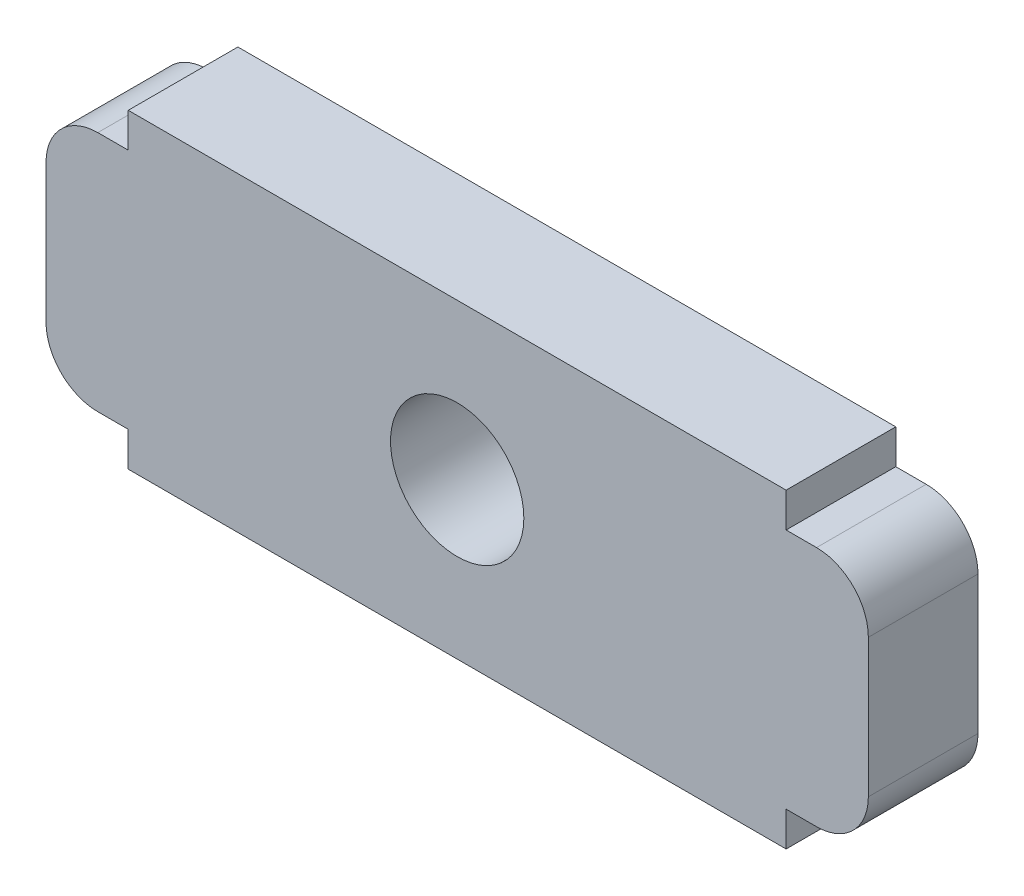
ISO-10303-21;
HEADER;
FILE_DESCRIPTION(('STEP AP214'),'2;1');
FILE_NAME('part.step','',(''),(''),'','','');
FILE_SCHEMA(('AUTOMOTIVE_DESIGN { 1 0 10303 214 1 1 1 1 }'));
ENDSEC;
DATA;
#1=APPLICATION_CONTEXT('core data for automotive mechanical design processes');
#2=APPLICATION_PROTOCOL_DEFINITION('international standard','automotive_design',2000,#1);
#3=PRODUCT_CONTEXT('',#1,'mechanical');
#4=PRODUCT('Part','Part','',(#3));
#5=PRODUCT_RELATED_PRODUCT_CATEGORY('part','',(#4));
#6=PRODUCT_DEFINITION_FORMATION('','',#4);
#7=PRODUCT_DEFINITION_CONTEXT('part definition',#1,'design');
#8=PRODUCT_DEFINITION('design','',#6,#7);
#9=PRODUCT_DEFINITION_SHAPE('','',#8);
#10=(LENGTH_UNIT() NAMED_UNIT(*) SI_UNIT(.MILLI.,.METRE.));
#11=(NAMED_UNIT(*) PLANE_ANGLE_UNIT() SI_UNIT($,.RADIAN.));
#12=(NAMED_UNIT(*) SI_UNIT($,.STERADIAN.) SOLID_ANGLE_UNIT());
#13=UNCERTAINTY_MEASURE_WITH_UNIT(LENGTH_MEASURE(1.E-05),#10,'distance_accuracy_value','');
#14=(GEOMETRIC_REPRESENTATION_CONTEXT(3) GLOBAL_UNCERTAINTY_ASSIGNED_CONTEXT((#13)) GLOBAL_UNIT_ASSIGNED_CONTEXT((#10,
#11,#12)) REPRESENTATION_CONTEXT('',''));
#15=CARTESIAN_POINT('',(0.,0.,0.));
#16=DIRECTION('',(0.,0.,1.));
#17=DIRECTION('',(1.,0.,0.));
#18=AXIS2_PLACEMENT_3D('',#15,#16,#17);
#19=CARTESIAN_POINT('',(0.,0.,3.175));
#20=DIRECTION('',(0.,0.,1.));
#21=DIRECTION('',(1.,0.,0.));
#22=AXIS2_PLACEMENT_3D('',#19,#20,#21);
#23=PLANE('',#22);
#24=DIRECTION('',(0.,1.,0.));
#25=VECTOR('',#24,1.);
#26=CARTESIAN_POINT('',(11.90625,3.5,3.175));
#27=LINE('',#26,#25);
#28=CARTESIAN_POINT('',(11.90625,-2.,3.175));
#29=VERTEX_POINT('',#28);
#30=CARTESIAN_POINT('',(11.90625,2.,3.175));
#31=VERTEX_POINT('',#30);
#32=EDGE_CURVE('E284',#29,#31,#27,.T.);
#33=ORIENTED_EDGE('',*,*,#32,.T.);
#34=CARTESIAN_POINT('',(10.40625,2.,3.175));
#35=DIRECTION('',(0.,0.,1.));
#36=DIRECTION('',(1.,0.,0.));
#37=AXIS2_PLACEMENT_3D('',#34,#35,#36);
#38=CIRCLE('',#37,1.5);
#39=CARTESIAN_POINT('',(10.40625,3.5,3.175));
#40=VERTEX_POINT('',#39);
#41=EDGE_CURVE('E200',#31,#40,#38,.T.);
#42=ORIENTED_EDGE('',*,*,#41,.T.);
#43=DIRECTION('',(-1.,0.,0.));
#44=VECTOR('',#43,1.);
#45=CARTESIAN_POINT('',(9.525,3.5,3.175));
#46=LINE('',#45,#44);
#47=CARTESIAN_POINT('',(9.525,3.5,3.175));
#48=VERTEX_POINT('',#47);
#49=EDGE_CURVE('E165',#40,#48,#46,.T.);
#50=ORIENTED_EDGE('',*,*,#49,.T.);
#51=DIRECTION('',(0.,1.,0.));
#52=VECTOR('',#51,1.);
#53=CARTESIAN_POINT('',(9.525,4.5,3.175));
#54=LINE('',#53,#52);
#55=CARTESIAN_POINT('',(9.525,4.5,3.175));
#56=VERTEX_POINT('',#55);
#57=EDGE_CURVE('E159',#48,#56,#54,.T.);
#58=ORIENTED_EDGE('',*,*,#57,.T.);
#59=DIRECTION('',(-1.,0.,0.));
#60=VECTOR('',#59,1.);
#61=CARTESIAN_POINT('',(-9.525,4.5,3.175));
#62=LINE('',#61,#60);
#63=CARTESIAN_POINT('',(-9.525,4.5,3.175));
#64=VERTEX_POINT('',#63);
#65=EDGE_CURVE('E149',#56,#64,#62,.T.);
#66=ORIENTED_EDGE('',*,*,#65,.T.);
#67=DIRECTION('',(0.,-1.,0.));
#68=VECTOR('',#67,1.);
#69=CARTESIAN_POINT('',(-9.525,4.5,3.175));
#70=LINE('',#69,#68);
#71=CARTESIAN_POINT('',(-9.525,3.5,3.175));
#72=VERTEX_POINT('',#71);
#73=EDGE_CURVE('E158',#64,#72,#70,.T.);
#74=ORIENTED_EDGE('',*,*,#73,.T.);
#75=DIRECTION('',(-1.,0.,0.));
#76=VECTOR('',#75,1.);
#77=CARTESIAN_POINT('',(-9.525,3.5,3.175));
#78=LINE('',#77,#76);
#79=CARTESIAN_POINT('',(-10.40625,3.5,3.175));
#80=VERTEX_POINT('',#79);
#81=EDGE_CURVE('E221',#72,#80,#78,.T.);
#82=ORIENTED_EDGE('',*,*,#81,.T.);
#83=CARTESIAN_POINT('',(-10.40625,2.,3.175));
#84=DIRECTION('',(0.,0.,1.));
#85=DIRECTION('',(1.,0.,0.));
#86=AXIS2_PLACEMENT_3D('',#83,#84,#85);
#87=CIRCLE('',#86,1.5);
#88=CARTESIAN_POINT('',(-11.90625,2.,3.175));
#89=VERTEX_POINT('',#88);
#90=EDGE_CURVE('E195',#80,#89,#87,.T.);
#91=ORIENTED_EDGE('',*,*,#90,.T.);
#92=DIRECTION('',(0.,-1.,0.));
#93=VECTOR('',#92,1.);
#94=CARTESIAN_POINT('',(-11.90625,3.5,3.175));
#95=LINE('',#94,#93);
#96=CARTESIAN_POINT('',(-11.90625,-2.,3.175));
#97=VERTEX_POINT('',#96);
#98=EDGE_CURVE('E213',#89,#97,#95,.T.);
#99=ORIENTED_EDGE('',*,*,#98,.T.);
#100=CARTESIAN_POINT('',(-10.40625,-2.,3.175));
#101=DIRECTION('',(0.,0.,1.));
#102=DIRECTION('',(1.,0.,0.));
#103=AXIS2_PLACEMENT_3D('',#100,#101,#102);
#104=CIRCLE('',#103,1.5);
#105=CARTESIAN_POINT('',(-10.40625,-3.5,3.175));
#106=VERTEX_POINT('',#105);
#107=EDGE_CURVE('E57',#97,#106,#104,.T.);
#108=ORIENTED_EDGE('',*,*,#107,.T.);
#109=DIRECTION('',(1.,0.,0.));
#110=VECTOR('',#109,1.);
#111=CARTESIAN_POINT('',(-11.90625,-3.5,3.175));
#112=LINE('',#111,#110);
#113=CARTESIAN_POINT('',(-9.525,-3.5,3.175));
#114=VERTEX_POINT('',#113);
#115=EDGE_CURVE('E220',#106,#114,#112,.T.);
#116=ORIENTED_EDGE('',*,*,#115,.T.);
#117=DIRECTION('',(0.,-1.,0.));
#118=VECTOR('',#117,1.);
#119=CARTESIAN_POINT('',(-9.525,-3.5,3.175));
#120=LINE('',#119,#118);
#121=CARTESIAN_POINT('',(-9.525,-4.5,3.175));
#122=VERTEX_POINT('',#121);
#123=EDGE_CURVE('E292',#114,#122,#120,.T.);
#124=ORIENTED_EDGE('',*,*,#123,.T.);
#125=DIRECTION('',(1.,0.,0.));
#126=VECTOR('',#125,1.);
#127=CARTESIAN_POINT('',(-9.525,-4.5,3.175));
#128=LINE('',#127,#126);
#129=CARTESIAN_POINT('',(9.525,-4.5,3.175));
#130=VERTEX_POINT('',#129);
#131=EDGE_CURVE('E290',#122,#130,#128,.T.);
#132=ORIENTED_EDGE('',*,*,#131,.T.);
#133=DIRECTION('',(0.,1.,0.));
#134=VECTOR('',#133,1.);
#135=CARTESIAN_POINT('',(9.525,-3.5,3.175));
#136=LINE('',#135,#134);
#137=CARTESIAN_POINT('',(9.525,-3.5,3.175));
#138=VERTEX_POINT('',#137);
#139=EDGE_CURVE('E288',#130,#138,#136,.T.);
#140=ORIENTED_EDGE('',*,*,#139,.T.);
#141=DIRECTION('',(1.,0.,0.));
#142=VECTOR('',#141,1.);
#143=CARTESIAN_POINT('',(11.90625,-3.5,3.175));
#144=LINE('',#143,#142);
#145=CARTESIAN_POINT('',(10.40625,-3.5,3.175));
#146=VERTEX_POINT('',#145);
#147=EDGE_CURVE('E286',#138,#146,#144,.T.);
#148=ORIENTED_EDGE('',*,*,#147,.T.);
#149=CARTESIAN_POINT('',(10.40625,-2.,3.175));
#150=DIRECTION('',(0.,0.,1.));
#151=DIRECTION('',(1.,0.,0.));
#152=AXIS2_PLACEMENT_3D('',#149,#150,#151);
#153=CIRCLE('',#152,1.5);
#154=EDGE_CURVE('E198',#146,#29,#153,.T.);
#155=ORIENTED_EDGE('',*,*,#154,.T.);
#156=EDGE_LOOP('',(#33,#42,#50,#58,#66,#74,#82,#91,#99,#108,#116,#124,#132,#140,#148,#155));
#157=FACE_BOUND('',#156,.T.);
#158=CARTESIAN_POINT('',(0.,0.,3.175));
#159=DIRECTION('',(0.,0.,1.));
#160=DIRECTION('',(1.,0.,0.));
#161=AXIS2_PLACEMENT_3D('',#158,#159,#160);
#162=CIRCLE('',#161,1.9304);
#163=CARTESIAN_POINT('',(1.9304,0.,3.175));
#164=VERTEX_POINT('',#163);
#165=EDGE_CURVE('E282',#164,#164,#162,.T.);
#166=ORIENTED_EDGE('',*,*,#165,.F.);
#167=EDGE_LOOP('',(#166));
#168=FACE_BOUND('',#167,.T.);
#169=ADVANCED_FACE('F34',(#157,#168),#23,.T.);
#170=CARTESIAN_POINT('',(0.,0.,0.));
#171=DIRECTION('',(0.,0.,1.));
#172=DIRECTION('',(1.,0.,0.));
#173=AXIS2_PLACEMENT_3D('',#170,#171,#172);
#174=PLANE('',#173);
#175=DIRECTION('',(-1.,0.,0.));
#176=VECTOR('',#175,1.);
#177=CARTESIAN_POINT('',(9.525,3.5,0.));
#178=LINE('',#177,#176);
#179=CARTESIAN_POINT('',(10.40625,3.5,0.));
#180=VERTEX_POINT('',#179);
#181=CARTESIAN_POINT('',(9.525,3.5,0.));
#182=VERTEX_POINT('',#181);
#183=EDGE_CURVE('E169',#180,#182,#178,.T.);
#184=ORIENTED_EDGE('',*,*,#183,.F.);
#185=CARTESIAN_POINT('',(10.40625,2.,0.));
#186=DIRECTION('',(0.,0.,1.));
#187=DIRECTION('',(1.,0.,0.));
#188=AXIS2_PLACEMENT_3D('',#185,#186,#187);
#189=CIRCLE('',#188,1.5);
#190=CARTESIAN_POINT('',(11.90625,2.,0.));
#191=VERTEX_POINT('',#190);
#192=EDGE_CURVE('E188',#180,#191,#189,.F.);
#193=ORIENTED_EDGE('',*,*,#192,.T.);
#194=DIRECTION('',(0.,1.,0.));
#195=VECTOR('',#194,1.);
#196=CARTESIAN_POINT('',(11.90625,3.5,0.));
#197=LINE('',#196,#195);
#198=CARTESIAN_POINT('',(11.90625,-2.,0.));
#199=VERTEX_POINT('',#198);
#200=EDGE_CURVE('E250',#199,#191,#197,.T.);
#201=ORIENTED_EDGE('',*,*,#200,.F.);
#202=CARTESIAN_POINT('',(10.40625,-2.,0.));
#203=DIRECTION('',(0.,0.,1.));
#204=DIRECTION('',(1.,0.,0.));
#205=AXIS2_PLACEMENT_3D('',#202,#203,#204);
#206=CIRCLE('',#205,1.5);
#207=CARTESIAN_POINT('',(10.40625,-3.5,0.));
#208=VERTEX_POINT('',#207);
#209=EDGE_CURVE('E186',#199,#208,#206,.F.);
#210=ORIENTED_EDGE('',*,*,#209,.T.);
#211=DIRECTION('',(1.,0.,0.));
#212=VECTOR('',#211,1.);
#213=CARTESIAN_POINT('',(11.90625,-3.5,0.));
#214=LINE('',#213,#212);
#215=CARTESIAN_POINT('',(9.525,-3.5,0.));
#216=VERTEX_POINT('',#215);
#217=EDGE_CURVE('E248',#216,#208,#214,.T.);
#218=ORIENTED_EDGE('',*,*,#217,.F.);
#219=DIRECTION('',(0.,1.,0.));
#220=VECTOR('',#219,1.);
#221=CARTESIAN_POINT('',(9.525,-3.5,0.));
#222=LINE('',#221,#220);
#223=CARTESIAN_POINT('',(9.525,-4.5,0.));
#224=VERTEX_POINT('',#223);
#225=EDGE_CURVE('E246',#224,#216,#222,.T.);
#226=ORIENTED_EDGE('',*,*,#225,.F.);
#227=DIRECTION('',(1.,0.,0.));
#228=VECTOR('',#227,1.);
#229=CARTESIAN_POINT('',(-9.525,-4.5,0.));
#230=LINE('',#229,#228);
#231=CARTESIAN_POINT('',(-9.525,-4.5,0.));
#232=VERTEX_POINT('',#231);
#233=EDGE_CURVE('E239',#232,#224,#230,.T.);
#234=ORIENTED_EDGE('',*,*,#233,.F.);
#235=DIRECTION('',(0.,-1.,0.));
#236=VECTOR('',#235,1.);
#237=CARTESIAN_POINT('',(-9.525,-3.5,0.));
#238=LINE('',#237,#236);
#239=CARTESIAN_POINT('',(-9.525,-3.5,0.));
#240=VERTEX_POINT('',#239);
#241=EDGE_CURVE('E237',#240,#232,#238,.T.);
#242=ORIENTED_EDGE('',*,*,#241,.F.);
#243=DIRECTION('',(1.,0.,0.));
#244=VECTOR('',#243,1.);
#245=CARTESIAN_POINT('',(-11.90625,-3.5,0.));
#246=LINE('',#245,#244);
#247=CARTESIAN_POINT('',(-10.40625,-3.5,0.));
#248=VERTEX_POINT('',#247);
#249=EDGE_CURVE('E229',#248,#240,#246,.T.);
#250=ORIENTED_EDGE('',*,*,#249,.F.);
#251=CARTESIAN_POINT('',(-10.40625,-2.,0.));
#252=DIRECTION('',(0.,0.,1.));
#253=DIRECTION('',(1.,0.,0.));
#254=AXIS2_PLACEMENT_3D('',#251,#252,#253);
#255=CIRCLE('',#254,1.5);
#256=CARTESIAN_POINT('',(-11.90625,-2.,0.));
#257=VERTEX_POINT('',#256);
#258=EDGE_CURVE('E184',#248,#257,#255,.F.);
#259=ORIENTED_EDGE('',*,*,#258,.T.);
#260=DIRECTION('',(0.,-1.,0.));
#261=VECTOR('',#260,1.);
#262=CARTESIAN_POINT('',(-11.90625,3.5,0.));
#263=LINE('',#262,#261);
#264=CARTESIAN_POINT('',(-11.90625,2.,0.));
#265=VERTEX_POINT('',#264);
#266=EDGE_CURVE('E216',#265,#257,#263,.T.);
#267=ORIENTED_EDGE('',*,*,#266,.F.);
#268=CARTESIAN_POINT('',(-10.40625,2.,0.));
#269=DIRECTION('',(0.,0.,1.));
#270=DIRECTION('',(1.,0.,0.));
#271=AXIS2_PLACEMENT_3D('',#268,#269,#270);
#272=CIRCLE('',#271,1.5);
#273=CARTESIAN_POINT('',(-10.40625,3.5,0.));
#274=VERTEX_POINT('',#273);
#275=EDGE_CURVE('E177',#265,#274,#272,.F.);
#276=ORIENTED_EDGE('',*,*,#275,.T.);
#277=DIRECTION('',(-1.,0.,0.));
#278=VECTOR('',#277,1.);
#279=CARTESIAN_POINT('',(-9.525,3.5,0.));
#280=LINE('',#279,#278);
#281=CARTESIAN_POINT('',(-9.525,3.5,0.));
#282=VERTEX_POINT('',#281);
#283=EDGE_CURVE('E241',#282,#274,#280,.T.);
#284=ORIENTED_EDGE('',*,*,#283,.F.);
#285=DIRECTION('',(0.,-1.,0.));
#286=VECTOR('',#285,1.);
#287=CARTESIAN_POINT('',(-9.525,4.5,0.));
#288=LINE('',#287,#286);
#289=CARTESIAN_POINT('',(-9.525,4.5,0.));
#290=VERTEX_POINT('',#289);
#291=EDGE_CURVE('E276',#290,#282,#288,.T.);
#292=ORIENTED_EDGE('',*,*,#291,.F.);
#293=DIRECTION('',(-1.,0.,0.));
#294=VECTOR('',#293,1.);
#295=CARTESIAN_POINT('',(-9.525,4.5,0.));
#296=LINE('',#295,#294);
#297=CARTESIAN_POINT('',(9.525,4.5,0.));
#298=VERTEX_POINT('',#297);
#299=EDGE_CURVE('E277',#298,#290,#296,.T.);
#300=ORIENTED_EDGE('',*,*,#299,.F.);
#301=DIRECTION('',(0.,1.,0.));
#302=VECTOR('',#301,1.);
#303=CARTESIAN_POINT('',(9.525,4.5,0.));
#304=LINE('',#303,#302);
#305=EDGE_CURVE('E173',#182,#298,#304,.T.);
#306=ORIENTED_EDGE('',*,*,#305,.F.);
#307=EDGE_LOOP('',(#184,#193,#201,#210,#218,#226,#234,#242,#250,#259,#267,#276,#284,#292,#300,#306));
#308=FACE_BOUND('',#307,.T.);
#309=CARTESIAN_POINT('',(0.,0.,0.));
#310=DIRECTION('',(0.,0.,1.));
#311=DIRECTION('',(1.,0.,0.));
#312=AXIS2_PLACEMENT_3D('',#309,#310,#311);
#313=CIRCLE('',#312,1.9304);
#314=CARTESIAN_POINT('',(1.9304,0.,0.));
#315=VERTEX_POINT('',#314);
#316=EDGE_CURVE('E297',#315,#315,#313,.T.);
#317=ORIENTED_EDGE('',*,*,#316,.T.);
#318=EDGE_LOOP('',(#317));
#319=FACE_BOUND('',#318,.T.);
#320=ADVANCED_FACE('F234',(#308,#319),#174,.F.);
#321=CARTESIAN_POINT('',(9.525,4.5,3.175));
#322=DIRECTION('',(-1.,0.,0.));
#323=DIRECTION('',(0.,0.,1.));
#324=AXIS2_PLACEMENT_3D('',#321,#322,#323);
#325=PLANE('',#324);
#326=ORIENTED_EDGE('',*,*,#305,.T.);
#327=DIRECTION('',(0.,0.,-1.));
#328=VECTOR('',#327,1.);
#329=CARTESIAN_POINT('',(9.525,4.5,3.175));
#330=LINE('',#329,#328);
#331=EDGE_CURVE('E153',#56,#298,#330,.T.);
#332=ORIENTED_EDGE('',*,*,#331,.F.);
#333=ORIENTED_EDGE('',*,*,#57,.F.);
#334=DIRECTION('',(0.,0.,-1.));
#335=VECTOR('',#334,1.);
#336=CARTESIAN_POINT('',(9.525,3.5,3.175));
#337=LINE('',#336,#335);
#338=EDGE_CURVE('E254',#48,#182,#337,.T.);
#339=ORIENTED_EDGE('',*,*,#338,.T.);
#340=EDGE_LOOP('',(#326,#332,#333,#339));
#341=FACE_BOUND('',#340,.T.);
#342=ADVANCED_FACE('F171',(#341),#325,.F.);
#343=CARTESIAN_POINT('',(-9.525,4.5,3.175));
#344=DIRECTION('',(0.,-1.,0.));
#345=DIRECTION('',(0.,0.,-1.));
#346=AXIS2_PLACEMENT_3D('',#343,#344,#345);
#347=PLANE('',#346);
#348=ORIENTED_EDGE('',*,*,#299,.T.);
#349=DIRECTION('',(0.,0.,-1.));
#350=VECTOR('',#349,1.);
#351=CARTESIAN_POINT('',(-9.525,4.5,3.175));
#352=LINE('',#351,#350);
#353=EDGE_CURVE('E156',#64,#290,#352,.T.);
#354=ORIENTED_EDGE('',*,*,#353,.F.);
#355=ORIENTED_EDGE('',*,*,#65,.F.);
#356=ORIENTED_EDGE('',*,*,#331,.T.);
#357=EDGE_LOOP('',(#348,#354,#355,#356));
#358=FACE_BOUND('',#357,.T.);
#359=ADVANCED_FACE('F151',(#358),#347,.F.);
#360=CARTESIAN_POINT('',(-9.525,4.5,3.175));
#361=DIRECTION('',(1.,0.,0.));
#362=DIRECTION('',(0.,1.,0.));
#363=AXIS2_PLACEMENT_3D('',#360,#361,#362);
#364=PLANE('',#363);
#365=ORIENTED_EDGE('',*,*,#291,.T.);
#366=DIRECTION('',(0.,0.,-1.));
#367=VECTOR('',#366,1.);
#368=CARTESIAN_POINT('',(-9.525,3.5,3.175));
#369=LINE('',#368,#367);
#370=EDGE_CURVE('E179',#72,#282,#369,.T.);
#371=ORIENTED_EDGE('',*,*,#370,.F.);
#372=ORIENTED_EDGE('',*,*,#73,.F.);
#373=ORIENTED_EDGE('',*,*,#353,.T.);
#374=EDGE_LOOP('',(#365,#371,#372,#373));
#375=FACE_BOUND('',#374,.T.);
#376=ADVANCED_FACE('F342',(#375),#364,.F.);
#377=CARTESIAN_POINT('',(-9.525,3.5,3.175));
#378=DIRECTION('',(0.,-1.,0.));
#379=DIRECTION('',(1.,0.,0.));
#380=AXIS2_PLACEMENT_3D('',#377,#378,#379);
#381=PLANE('',#380);
#382=ORIENTED_EDGE('',*,*,#283,.T.);
#383=DIRECTION('',(0.,0.,-1.));
#384=VECTOR('',#383,1.);
#385=CARTESIAN_POINT('',(-10.40625,3.5,3.175));
#386=LINE('',#385,#384);
#387=EDGE_CURVE('E11',#274,#80,#386,.F.);
#388=ORIENTED_EDGE('',*,*,#387,.T.);
#389=ORIENTED_EDGE('',*,*,#81,.F.);
#390=ORIENTED_EDGE('',*,*,#370,.T.);
#391=EDGE_LOOP('',(#382,#388,#389,#390));
#392=FACE_BOUND('',#391,.T.);
#393=ADVANCED_FACE('F272',(#392),#381,.F.);
#394=CARTESIAN_POINT('',(-11.90625,3.5,3.175));
#395=DIRECTION('',(1.,0.,0.));
#396=DIRECTION('',(0.,0.,-1.));
#397=AXIS2_PLACEMENT_3D('',#394,#395,#396);
#398=PLANE('',#397);
#399=ORIENTED_EDGE('',*,*,#266,.T.);
#400=DIRECTION('',(0.,0.,-1.));
#401=VECTOR('',#400,1.);
#402=CARTESIAN_POINT('',(-11.90625,-2.,3.175));
#403=LINE('',#402,#401);
#404=EDGE_CURVE('E42',#257,#97,#403,.F.);
#405=ORIENTED_EDGE('',*,*,#404,.T.);
#406=ORIENTED_EDGE('',*,*,#98,.F.);
#407=DIRECTION('',(0.,0.,-1.));
#408=VECTOR('',#407,1.);
#409=CARTESIAN_POINT('',(-11.90625,2.,3.175));
#410=LINE('',#409,#408);
#411=EDGE_CURVE('E206',#89,#265,#410,.T.);
#412=ORIENTED_EDGE('',*,*,#411,.T.);
#413=EDGE_LOOP('',(#399,#405,#406,#412));
#414=FACE_BOUND('',#413,.T.);
#415=ADVANCED_FACE('F212',(#414),#398,.F.);
#416=CARTESIAN_POINT('',(-11.90625,-3.5,3.175));
#417=DIRECTION('',(0.,1.,0.));
#418=DIRECTION('',(-1.,0.,0.));
#419=AXIS2_PLACEMENT_3D('',#416,#417,#418);
#420=PLANE('',#419);
#421=ORIENTED_EDGE('',*,*,#115,.F.);
#422=DIRECTION('',(0.,0.,-1.));
#423=VECTOR('',#422,1.);
#424=CARTESIAN_POINT('',(-10.40625,-3.5,3.175));
#425=LINE('',#424,#423);
#426=EDGE_CURVE('E203',#106,#248,#425,.T.);
#427=ORIENTED_EDGE('',*,*,#426,.T.);
#428=ORIENTED_EDGE('',*,*,#249,.T.);
#429=DIRECTION('',(0.,0.,-1.));
#430=VECTOR('',#429,1.);
#431=CARTESIAN_POINT('',(-9.525,-3.5,3.175));
#432=LINE('',#431,#430);
#433=EDGE_CURVE('E265',#114,#240,#432,.T.);
#434=ORIENTED_EDGE('',*,*,#433,.F.);
#435=EDGE_LOOP('',(#421,#427,#428,#434));
#436=FACE_BOUND('',#435,.T.);
#437=ADVANCED_FACE('F227',(#436),#420,.F.);
#438=CARTESIAN_POINT('',(-9.525,-3.5,3.175));
#439=DIRECTION('',(1.,0.,0.));
#440=DIRECTION('',(0.,1.,0.));
#441=AXIS2_PLACEMENT_3D('',#438,#439,#440);
#442=PLANE('',#441);
#443=ORIENTED_EDGE('',*,*,#241,.T.);
#444=DIRECTION('',(0.,0.,-1.));
#445=VECTOR('',#444,1.);
#446=CARTESIAN_POINT('',(-9.525,-4.5,3.175));
#447=LINE('',#446,#445);
#448=EDGE_CURVE('E262',#122,#232,#447,.T.);
#449=ORIENTED_EDGE('',*,*,#448,.F.);
#450=ORIENTED_EDGE('',*,*,#123,.F.);
#451=ORIENTED_EDGE('',*,*,#433,.T.);
#452=EDGE_LOOP('',(#443,#449,#450,#451));
#453=FACE_BOUND('',#452,.T.);
#454=ADVANCED_FACE('F331',(#453),#442,.F.);
#455=CARTESIAN_POINT('',(-9.525,-4.5,3.175));
#456=DIRECTION('',(0.,1.,0.));
#457=DIRECTION('',(-1.,0.,0.));
#458=AXIS2_PLACEMENT_3D('',#455,#456,#457);
#459=PLANE('',#458);
#460=ORIENTED_EDGE('',*,*,#233,.T.);
#461=DIRECTION('',(0.,0.,-1.));
#462=VECTOR('',#461,1.);
#463=CARTESIAN_POINT('',(9.525,-4.5,3.175));
#464=LINE('',#463,#462);
#465=EDGE_CURVE('E259',#130,#224,#464,.T.);
#466=ORIENTED_EDGE('',*,*,#465,.F.);
#467=ORIENTED_EDGE('',*,*,#131,.F.);
#468=ORIENTED_EDGE('',*,*,#448,.T.);
#469=EDGE_LOOP('',(#460,#466,#467,#468));
#470=FACE_BOUND('',#469,.T.);
#471=ADVANCED_FACE('F327',(#470),#459,.F.);
#472=CARTESIAN_POINT('',(9.525,-3.5,3.175));
#473=DIRECTION('',(-1.,0.,0.));
#474=DIRECTION('',(0.,-1.,0.));
#475=AXIS2_PLACEMENT_3D('',#472,#473,#474);
#476=PLANE('',#475);
#477=ORIENTED_EDGE('',*,*,#225,.T.);
#478=DIRECTION('',(0.,0.,-1.));
#479=VECTOR('',#478,1.);
#480=CARTESIAN_POINT('',(9.525,-3.5,3.175));
#481=LINE('',#480,#479);
#482=EDGE_CURVE('E256',#138,#216,#481,.T.);
#483=ORIENTED_EDGE('',*,*,#482,.F.);
#484=ORIENTED_EDGE('',*,*,#139,.F.);
#485=ORIENTED_EDGE('',*,*,#465,.T.);
#486=EDGE_LOOP('',(#477,#483,#484,#485));
#487=FACE_BOUND('',#486,.T.);
#488=ADVANCED_FACE('F324',(#487),#476,.F.);
#489=CARTESIAN_POINT('',(11.90625,-3.5,3.175));
#490=DIRECTION('',(0.,1.,0.));
#491=DIRECTION('',(-1.,0.,0.));
#492=AXIS2_PLACEMENT_3D('',#489,#490,#491);
#493=PLANE('',#492);
#494=ORIENTED_EDGE('',*,*,#217,.T.);
#495=DIRECTION('',(0.,0.,-1.));
#496=VECTOR('',#495,1.);
#497=CARTESIAN_POINT('',(10.40625,-3.5,3.175));
#498=LINE('',#497,#496);
#499=EDGE_CURVE('E49',#208,#146,#498,.F.);
#500=ORIENTED_EDGE('',*,*,#499,.T.);
#501=ORIENTED_EDGE('',*,*,#147,.F.);
#502=ORIENTED_EDGE('',*,*,#482,.T.);
#503=EDGE_LOOP('',(#494,#500,#501,#502));
#504=FACE_BOUND('',#503,.T.);
#505=ADVANCED_FACE('F320',(#504),#493,.F.);
#506=CARTESIAN_POINT('',(11.90625,3.5,3.175));
#507=DIRECTION('',(-1.,0.,0.));
#508=DIRECTION('',(0.,0.,1.));
#509=AXIS2_PLACEMENT_3D('',#506,#507,#508);
#510=PLANE('',#509);
#511=ORIENTED_EDGE('',*,*,#200,.T.);
#512=DIRECTION('',(0.,0.,-1.));
#513=VECTOR('',#512,1.);
#514=CARTESIAN_POINT('',(11.90625,2.,3.175));
#515=LINE('',#514,#513);
#516=EDGE_CURVE('E193',#191,#31,#515,.F.);
#517=ORIENTED_EDGE('',*,*,#516,.T.);
#518=ORIENTED_EDGE('',*,*,#32,.F.);
#519=DIRECTION('',(0.,0.,-1.));
#520=VECTOR('',#519,1.);
#521=CARTESIAN_POINT('',(11.90625,-2.,3.175));
#522=LINE('',#521,#520);
#523=EDGE_CURVE('E190',#29,#199,#522,.T.);
#524=ORIENTED_EDGE('',*,*,#523,.T.);
#525=EDGE_LOOP('',(#511,#517,#518,#524));
#526=FACE_BOUND('',#525,.T.);
#527=ADVANCED_FACE('F316',(#526),#510,.F.);
#528=CARTESIAN_POINT('',(9.525,3.5,3.175));
#529=DIRECTION('',(0.,-1.,0.));
#530=DIRECTION('',(1.,0.,0.));
#531=AXIS2_PLACEMENT_3D('',#528,#529,#530);
#532=PLANE('',#531);
#533=ORIENTED_EDGE('',*,*,#49,.F.);
#534=DIRECTION('',(0.,0.,-1.));
#535=VECTOR('',#534,1.);
#536=CARTESIAN_POINT('',(10.40625,3.5,3.175));
#537=LINE('',#536,#535);
#538=EDGE_CURVE('E174',#40,#180,#537,.T.);
#539=ORIENTED_EDGE('',*,*,#538,.T.);
#540=ORIENTED_EDGE('',*,*,#183,.T.);
#541=ORIENTED_EDGE('',*,*,#338,.F.);
#542=EDGE_LOOP('',(#533,#539,#540,#541));
#543=FACE_BOUND('',#542,.T.);
#544=ADVANCED_FACE('F313',(#543),#532,.F.);
#545=CARTESIAN_POINT('',(0.,0.,3.175));
#546=DIRECTION('',(0.,0.,-1.));
#547=DIRECTION('',(-1.,0.,0.));
#548=AXIS2_PLACEMENT_3D('',#545,#546,#547);
#549=CYLINDRICAL_SURFACE('',#548,1.9304);
#550=ORIENTED_EDGE('',*,*,#165,.T.);
#551=EDGE_LOOP('',(#550));
#552=FACE_BOUND('',#551,.T.);
#553=ORIENTED_EDGE('',*,*,#316,.F.);
#554=EDGE_LOOP('',(#553));
#555=FACE_BOUND('',#554,.T.);
#556=ADVANCED_FACE('F303',(#552,#555),#549,.F.);
#557=CARTESIAN_POINT('',(10.40625,2.,3.175));
#558=DIRECTION('',(0.,0.,-1.));
#559=DIRECTION('',(-1.,0.,0.));
#560=AXIS2_PLACEMENT_3D('',#557,#558,#559);
#561=CYLINDRICAL_SURFACE('',#560,1.5);
#562=ORIENTED_EDGE('',*,*,#41,.F.);
#563=ORIENTED_EDGE('',*,*,#516,.F.);
#564=ORIENTED_EDGE('',*,*,#192,.F.);
#565=ORIENTED_EDGE('',*,*,#538,.F.);
#566=EDGE_LOOP('',(#562,#563,#564,#565));
#567=FACE_BOUND('',#566,.T.);
#568=ADVANCED_FACE('F349',(#567),#561,.T.);
#569=CARTESIAN_POINT('',(10.40625,-2.,3.175));
#570=DIRECTION('',(0.,0.,-1.));
#571=DIRECTION('',(-1.,0.,0.));
#572=AXIS2_PLACEMENT_3D('',#569,#570,#571);
#573=CYLINDRICAL_SURFACE('',#572,1.5);
#574=ORIENTED_EDGE('',*,*,#154,.F.);
#575=ORIENTED_EDGE('',*,*,#499,.F.);
#576=ORIENTED_EDGE('',*,*,#209,.F.);
#577=ORIENTED_EDGE('',*,*,#523,.F.);
#578=EDGE_LOOP('',(#574,#575,#576,#577));
#579=FACE_BOUND('',#578,.T.);
#580=ADVANCED_FACE('F352',(#579),#573,.T.);
#581=CARTESIAN_POINT('',(-10.40625,-2.,3.175));
#582=DIRECTION('',(0.,0.,-1.));
#583=DIRECTION('',(-1.,0.,0.));
#584=AXIS2_PLACEMENT_3D('',#581,#582,#583);
#585=CYLINDRICAL_SURFACE('',#584,1.5);
#586=ORIENTED_EDGE('',*,*,#107,.F.);
#587=ORIENTED_EDGE('',*,*,#404,.F.);
#588=ORIENTED_EDGE('',*,*,#258,.F.);
#589=ORIENTED_EDGE('',*,*,#426,.F.);
#590=EDGE_LOOP('',(#586,#587,#588,#589));
#591=FACE_BOUND('',#590,.T.);
#592=ADVANCED_FACE('F224',(#591),#585,.T.);
#593=CARTESIAN_POINT('',(-10.40625,2.,3.175));
#594=DIRECTION('',(0.,0.,-1.));
#595=DIRECTION('',(-1.,0.,0.));
#596=AXIS2_PLACEMENT_3D('',#593,#594,#595);
#597=CYLINDRICAL_SURFACE('',#596,1.5);
#598=ORIENTED_EDGE('',*,*,#90,.F.);
#599=ORIENTED_EDGE('',*,*,#387,.F.);
#600=ORIENTED_EDGE('',*,*,#275,.F.);
#601=ORIENTED_EDGE('',*,*,#411,.F.);
#602=EDGE_LOOP('',(#598,#599,#600,#601));
#603=FACE_BOUND('',#602,.T.);
#604=ADVANCED_FACE('F36',(#603),#597,.T.);
#605=CLOSED_SHELL('',(#169,#320,#342,#359,#376,#393,#415,#437,#454,#471,#488,#505,#527,#544,
#556,#568,#580,#592,#604));
#606=MANIFOLD_SOLID_BREP('B2',#605);
#607=ADVANCED_BREP_SHAPE_REPRESENTATION('',(#18,#606),#14);
#608=SHAPE_DEFINITION_REPRESENTATION(#9,#607);
ENDSEC;
END-ISO-10303-21;
